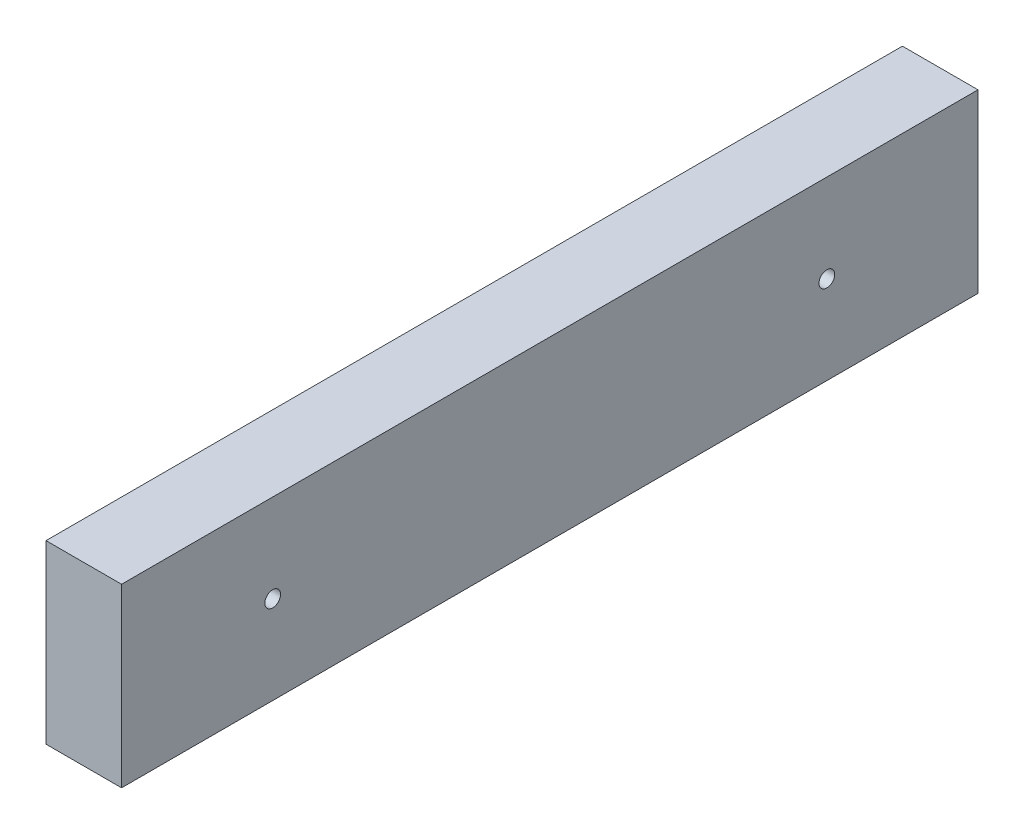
from build123d import *

# Parameters (mm, degrees)
SKETCH1_W                      = 38.1
SKETCH1_H                      = 88.9
BOSS_EXTRUDE1_DEPTH            = 431.8
F_5_16_0_3125_DIAMETER_HOLE1_D = 7.9375


with BuildPart() as part:
    # Sketch1 → Boss-Extrude1 (new body)
    with BuildSketch(Plane.XY):
        Rectangle(SKETCH1_W, SKETCH1_H)
    extrude(amount=BOSS_EXTRUDE1_DEPTH)

    # 5_16 _0.3125_ Diameter Hole1 (through all)
    with Locations(Plane(origin=(19.05, 0, 0), x_dir=(0, 0, -1), z_dir=(1, 0, 0))):
        with Locations((-355.6, 0), (-76.2, 0)):
            Hole(F_5_16_0_3125_DIAMETER_HOLE1_D / 2)


solid = part.part
